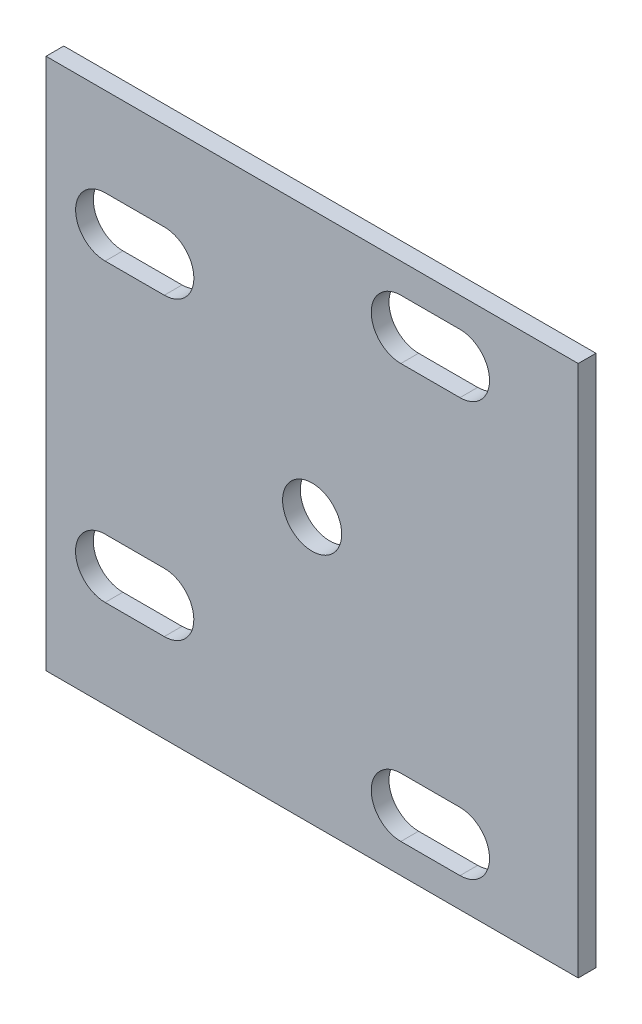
ISO-10303-21;
HEADER;
FILE_DESCRIPTION(('STEP AP214'),'2;1');
FILE_NAME('part.step','',(''),(''),'','','');
FILE_SCHEMA(('AUTOMOTIVE_DESIGN { 1 0 10303 214 1 1 1 1 }'));
ENDSEC;
DATA;
#1=APPLICATION_CONTEXT('core data for automotive mechanical design processes');
#2=APPLICATION_PROTOCOL_DEFINITION('international standard','automotive_design',2000,#1);
#3=PRODUCT_CONTEXT('',#1,'mechanical');
#4=PRODUCT('Part','Part','',(#3));
#5=PRODUCT_RELATED_PRODUCT_CATEGORY('part','',(#4));
#6=PRODUCT_DEFINITION_FORMATION('','',#4);
#7=PRODUCT_DEFINITION_CONTEXT('part definition',#1,'design');
#8=PRODUCT_DEFINITION('design','',#6,#7);
#9=PRODUCT_DEFINITION_SHAPE('','',#8);
#10=(LENGTH_UNIT() NAMED_UNIT(*) SI_UNIT(.MILLI.,.METRE.));
#11=(NAMED_UNIT(*) PLANE_ANGLE_UNIT() SI_UNIT($,.RADIAN.));
#12=(NAMED_UNIT(*) SI_UNIT($,.STERADIAN.) SOLID_ANGLE_UNIT());
#13=UNCERTAINTY_MEASURE_WITH_UNIT(LENGTH_MEASURE(1.E-05),#10,'distance_accuracy_value','');
#14=(GEOMETRIC_REPRESENTATION_CONTEXT(3) GLOBAL_UNCERTAINTY_ASSIGNED_CONTEXT((#13)) GLOBAL_UNIT_ASSIGNED_CONTEXT((#10,
#11,#12)) REPRESENTATION_CONTEXT('',''));
#15=CARTESIAN_POINT('',(0.,0.,0.));
#16=DIRECTION('',(0.,0.,1.));
#17=DIRECTION('',(1.,0.,0.));
#18=AXIS2_PLACEMENT_3D('',#15,#16,#17);
#19=CARTESIAN_POINT('',(0.,0.,3.));
#20=DIRECTION('',(0.,0.,-1.));
#21=DIRECTION('',(-1.,0.,0.));
#22=AXIS2_PLACEMENT_3D('',#19,#20,#21);
#23=PLANE('',#22);
#24=CARTESIAN_POINT('',(60.,80.,3.));
#25=DIRECTION('',(0.,0.,1.));
#26=DIRECTION('',(1.,0.,0.));
#27=AXIS2_PLACEMENT_3D('',#24,#25,#26);
#28=CIRCLE('',#27,5.);
#29=CARTESIAN_POINT('',(60.,85.,3.));
#30=VERTEX_POINT('',#29);
#31=CARTESIAN_POINT('',(60.,75.,3.));
#32=VERTEX_POINT('',#31);
#33=EDGE_CURVE('E209',#30,#32,#28,.T.);
#34=ORIENTED_EDGE('',*,*,#33,.F.);
#35=DIRECTION('',(-1.,0.,0.));
#36=VECTOR('',#35,1.);
#37=CARTESIAN_POINT('',(70.,85.,3.));
#38=LINE('',#37,#36);
#39=CARTESIAN_POINT('',(70.,85.,3.));
#40=VERTEX_POINT('',#39);
#41=EDGE_CURVE('E217',#40,#30,#38,.T.);
#42=ORIENTED_EDGE('',*,*,#41,.F.);
#43=CARTESIAN_POINT('',(70.,80.,3.));
#44=DIRECTION('',(0.,0.,1.));
#45=DIRECTION('',(1.,0.,0.));
#46=AXIS2_PLACEMENT_3D('',#43,#44,#45);
#47=CIRCLE('',#46,5.);
#48=CARTESIAN_POINT('',(70.,75.,3.));
#49=VERTEX_POINT('',#48);
#50=EDGE_CURVE('E214',#49,#40,#47,.T.);
#51=ORIENTED_EDGE('',*,*,#50,.F.);
#52=DIRECTION('',(1.,0.,0.));
#53=VECTOR('',#52,1.);
#54=CARTESIAN_POINT('',(70.,75.,3.));
#55=LINE('',#54,#53);
#56=EDGE_CURVE('E211',#32,#49,#55,.T.);
#57=ORIENTED_EDGE('',*,*,#56,.F.);
#58=EDGE_LOOP('',(#34,#42,#51,#57));
#59=FACE_BOUND('',#58,.T.);
#60=CARTESIAN_POINT('',(10.,70.,3.));
#61=DIRECTION('',(0.,0.,1.));
#62=DIRECTION('',(-1.,0.,0.));
#63=AXIS2_PLACEMENT_3D('',#60,#61,#62);
#64=CIRCLE('',#63,5.);
#65=CARTESIAN_POINT('',(10.,75.,3.));
#66=VERTEX_POINT('',#65);
#67=CARTESIAN_POINT('',(10.,65.,3.));
#68=VERTEX_POINT('',#67);
#69=EDGE_CURVE('E271',#66,#68,#64,.T.);
#70=ORIENTED_EDGE('',*,*,#69,.F.);
#71=DIRECTION('',(-1.,0.,0.));
#72=VECTOR('',#71,1.);
#73=CARTESIAN_POINT('',(10.,75.,3.));
#74=LINE('',#73,#72);
#75=CARTESIAN_POINT('',(20.,75.,3.));
#76=VERTEX_POINT('',#75);
#77=EDGE_CURVE('E279',#76,#66,#74,.T.);
#78=ORIENTED_EDGE('',*,*,#77,.F.);
#79=CARTESIAN_POINT('',(20.,70.,3.));
#80=DIRECTION('',(0.,0.,1.));
#81=DIRECTION('',(1.,0.,0.));
#82=AXIS2_PLACEMENT_3D('',#79,#80,#81);
#83=CIRCLE('',#82,5.);
#84=CARTESIAN_POINT('',(20.,65.,3.));
#85=VERTEX_POINT('',#84);
#86=EDGE_CURVE('E276',#85,#76,#83,.T.);
#87=ORIENTED_EDGE('',*,*,#86,.F.);
#88=DIRECTION('',(1.,0.,0.));
#89=VECTOR('',#88,1.);
#90=CARTESIAN_POINT('',(20.,65.,3.));
#91=LINE('',#90,#89);
#92=EDGE_CURVE('E273',#68,#85,#91,.T.);
#93=ORIENTED_EDGE('',*,*,#92,.F.);
#94=EDGE_LOOP('',(#70,#78,#87,#93));
#95=FACE_BOUND('',#94,.T.);
#96=DIRECTION('',(0.,-1.,0.));
#97=VECTOR('',#96,1.);
#98=CARTESIAN_POINT('',(0.,0.,3.));
#99=LINE('',#98,#97);
#100=CARTESIAN_POINT('',(0.,90.,3.));
#101=VERTEX_POINT('',#100);
#102=CARTESIAN_POINT('',(0.,0.,3.));
#103=VERTEX_POINT('',#102);
#104=EDGE_CURVE('E302',#101,#103,#99,.T.);
#105=ORIENTED_EDGE('',*,*,#104,.T.);
#106=DIRECTION('',(1.,0.,0.));
#107=VECTOR('',#106,1.);
#108=CARTESIAN_POINT('',(0.,0.,3.));
#109=LINE('',#108,#107);
#110=CARTESIAN_POINT('',(90.,0.,3.));
#111=VERTEX_POINT('',#110);
#112=EDGE_CURVE('E305',#103,#111,#109,.T.);
#113=ORIENTED_EDGE('',*,*,#112,.T.);
#114=DIRECTION('',(0.,1.,0.));
#115=VECTOR('',#114,1.);
#116=CARTESIAN_POINT('',(90.,0.,3.));
#117=LINE('',#116,#115);
#118=CARTESIAN_POINT('',(90.,90.,3.));
#119=VERTEX_POINT('',#118);
#120=EDGE_CURVE('E308',#111,#119,#117,.T.);
#121=ORIENTED_EDGE('',*,*,#120,.T.);
#122=DIRECTION('',(-1.,0.,0.));
#123=VECTOR('',#122,1.);
#124=CARTESIAN_POINT('',(0.,90.,3.));
#125=LINE('',#124,#123);
#126=EDGE_CURVE('E310',#119,#101,#125,.T.);
#127=ORIENTED_EDGE('',*,*,#126,.T.);
#128=EDGE_LOOP('',(#105,#113,#121,#127));
#129=FACE_BOUND('',#128,.T.);
#130=CARTESIAN_POINT('',(9.99115134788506,20.,3.));
#131=DIRECTION('',(0.,0.,1.));
#132=DIRECTION('',(-1.,0.,0.));
#133=AXIS2_PLACEMENT_3D('',#130,#131,#132);
#134=CIRCLE('',#133,5.);
#135=CARTESIAN_POINT('',(9.99115134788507,25.,3.));
#136=VERTEX_POINT('',#135);
#137=CARTESIAN_POINT('',(9.99115134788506,15.,3.));
#138=VERTEX_POINT('',#137);
#139=EDGE_CURVE('E240',#136,#138,#134,.T.);
#140=ORIENTED_EDGE('',*,*,#139,.F.);
#141=DIRECTION('',(-1.,0.,0.));
#142=VECTOR('',#141,1.);
#143=CARTESIAN_POINT('',(9.99115134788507,25.,3.));
#144=LINE('',#143,#142);
#145=CARTESIAN_POINT('',(19.9911513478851,25.,3.));
#146=VERTEX_POINT('',#145);
#147=EDGE_CURVE('E248',#146,#136,#144,.T.);
#148=ORIENTED_EDGE('',*,*,#147,.F.);
#149=CARTESIAN_POINT('',(19.9911513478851,20.,3.));
#150=DIRECTION('',(0.,0.,1.));
#151=DIRECTION('',(1.,0.,0.));
#152=AXIS2_PLACEMENT_3D('',#149,#150,#151);
#153=CIRCLE('',#152,5.);
#154=CARTESIAN_POINT('',(19.9911513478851,15.,3.));
#155=VERTEX_POINT('',#154);
#156=EDGE_CURVE('E245',#155,#146,#153,.T.);
#157=ORIENTED_EDGE('',*,*,#156,.F.);
#158=DIRECTION('',(1.,0.,0.));
#159=VECTOR('',#158,1.);
#160=CARTESIAN_POINT('',(19.9911513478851,15.,3.));
#161=LINE('',#160,#159);
#162=EDGE_CURVE('E242',#138,#155,#161,.T.);
#163=ORIENTED_EDGE('',*,*,#162,.F.);
#164=EDGE_LOOP('',(#140,#148,#157,#163));
#165=FACE_BOUND('',#164,.T.);
#166=CARTESIAN_POINT('',(60.,10.,3.));
#167=DIRECTION('',(0.,0.,1.));
#168=DIRECTION('',(-1.,0.,0.));
#169=AXIS2_PLACEMENT_3D('',#166,#167,#168);
#170=CIRCLE('',#169,5.);
#171=CARTESIAN_POINT('',(60.,15.,3.));
#172=VERTEX_POINT('',#171);
#173=CARTESIAN_POINT('',(60.,5.,3.));
#174=VERTEX_POINT('',#173);
#175=EDGE_CURVE('E170',#172,#174,#170,.T.);
#176=ORIENTED_EDGE('',*,*,#175,.F.);
#177=DIRECTION('',(-1.,0.,0.));
#178=VECTOR('',#177,1.);
#179=CARTESIAN_POINT('',(60.,15.,3.));
#180=LINE('',#179,#178);
#181=CARTESIAN_POINT('',(70.,15.,3.));
#182=VERTEX_POINT('',#181);
#183=EDGE_CURVE('E193',#182,#172,#180,.T.);
#184=ORIENTED_EDGE('',*,*,#183,.F.);
#185=CARTESIAN_POINT('',(70.,10.,3.));
#186=DIRECTION('',(0.,0.,1.));
#187=DIRECTION('',(1.,0.,0.));
#188=AXIS2_PLACEMENT_3D('',#185,#186,#187);
#189=CIRCLE('',#188,5.);
#190=CARTESIAN_POINT('',(70.,5.,3.));
#191=VERTEX_POINT('',#190);
#192=EDGE_CURVE('E191',#191,#182,#189,.T.);
#193=ORIENTED_EDGE('',*,*,#192,.F.);
#194=DIRECTION('',(1.,0.,0.));
#195=VECTOR('',#194,1.);
#196=CARTESIAN_POINT('',(70.,5.,3.));
#197=LINE('',#196,#195);
#198=EDGE_CURVE('E178',#174,#191,#197,.T.);
#199=ORIENTED_EDGE('',*,*,#198,.F.);
#200=EDGE_LOOP('',(#176,#184,#193,#199));
#201=FACE_BOUND('',#200,.T.);
#202=CARTESIAN_POINT('',(45.,45.,3.));
#203=DIRECTION('',(0.,0.,1.));
#204=DIRECTION('',(1.,0.,0.));
#205=AXIS2_PLACEMENT_3D('',#202,#203,#204);
#206=CIRCLE('',#205,5.);
#207=CARTESIAN_POINT('',(50.,45.,3.));
#208=VERTEX_POINT('',#207);
#209=EDGE_CURVE('E199',#208,#208,#206,.T.);
#210=ORIENTED_EDGE('',*,*,#209,.F.);
#211=EDGE_LOOP('',(#210));
#212=FACE_BOUND('',#211,.T.);
#213=ADVANCED_FACE('F33',(#59,#95,#129,#165,#201,#212),#23,.F.);
#214=CARTESIAN_POINT('',(0.,0.,0.));
#215=DIRECTION('',(0.,0.,-1.));
#216=DIRECTION('',(-1.,0.,0.));
#217=AXIS2_PLACEMENT_3D('',#214,#215,#216);
#218=PLANE('',#217);
#219=DIRECTION('',(-1.,0.,0.));
#220=VECTOR('',#219,1.);
#221=CARTESIAN_POINT('',(60.,15.,0.));
#222=LINE('',#221,#220);
#223=CARTESIAN_POINT('',(70.,15.,0.));
#224=VERTEX_POINT('',#223);
#225=CARTESIAN_POINT('',(60.,15.,0.));
#226=VERTEX_POINT('',#225);
#227=EDGE_CURVE('E179',#224,#226,#222,.T.);
#228=ORIENTED_EDGE('',*,*,#227,.T.);
#229=CARTESIAN_POINT('',(60.,10.,0.));
#230=DIRECTION('',(0.,0.,1.));
#231=DIRECTION('',(-1.,0.,0.));
#232=AXIS2_PLACEMENT_3D('',#229,#230,#231);
#233=CIRCLE('',#232,5.);
#234=CARTESIAN_POINT('',(60.,5.,0.));
#235=VERTEX_POINT('',#234);
#236=EDGE_CURVE('E56',#226,#235,#233,.T.);
#237=ORIENTED_EDGE('',*,*,#236,.T.);
#238=DIRECTION('',(1.,0.,0.));
#239=VECTOR('',#238,1.);
#240=CARTESIAN_POINT('',(70.,5.,0.));
#241=LINE('',#240,#239);
#242=CARTESIAN_POINT('',(70.,5.,0.));
#243=VERTEX_POINT('',#242);
#244=EDGE_CURVE('E185',#235,#243,#241,.T.);
#245=ORIENTED_EDGE('',*,*,#244,.T.);
#246=CARTESIAN_POINT('',(70.,10.,0.));
#247=DIRECTION('',(0.,0.,1.));
#248=DIRECTION('',(1.,0.,0.));
#249=AXIS2_PLACEMENT_3D('',#246,#247,#248);
#250=CIRCLE('',#249,5.);
#251=EDGE_CURVE('E201',#243,#224,#250,.T.);
#252=ORIENTED_EDGE('',*,*,#251,.T.);
#253=EDGE_LOOP('',(#228,#237,#245,#252));
#254=FACE_BOUND('',#253,.T.);
#255=DIRECTION('',(-1.,0.,0.));
#256=VECTOR('',#255,1.);
#257=CARTESIAN_POINT('',(70.,85.,0.));
#258=LINE('',#257,#256);
#259=CARTESIAN_POINT('',(70.,85.,0.));
#260=VERTEX_POINT('',#259);
#261=CARTESIAN_POINT('',(60.,85.,0.));
#262=VERTEX_POINT('',#261);
#263=EDGE_CURVE('E212',#260,#262,#258,.T.);
#264=ORIENTED_EDGE('',*,*,#263,.T.);
#265=CARTESIAN_POINT('',(60.,80.,0.));
#266=DIRECTION('',(0.,0.,1.));
#267=DIRECTION('',(1.,0.,0.));
#268=AXIS2_PLACEMENT_3D('',#265,#266,#267);
#269=CIRCLE('',#268,5.);
#270=CARTESIAN_POINT('',(60.,75.,0.));
#271=VERTEX_POINT('',#270);
#272=EDGE_CURVE('E186',#262,#271,#269,.T.);
#273=ORIENTED_EDGE('',*,*,#272,.T.);
#274=DIRECTION('',(1.,0.,0.));
#275=VECTOR('',#274,1.);
#276=CARTESIAN_POINT('',(70.,75.,0.));
#277=LINE('',#276,#275);
#278=CARTESIAN_POINT('',(70.,75.,0.));
#279=VERTEX_POINT('',#278);
#280=EDGE_CURVE('E222',#271,#279,#277,.T.);
#281=ORIENTED_EDGE('',*,*,#280,.T.);
#282=CARTESIAN_POINT('',(70.,80.,0.));
#283=DIRECTION('',(0.,0.,1.));
#284=DIRECTION('',(1.,0.,0.));
#285=AXIS2_PLACEMENT_3D('',#282,#283,#284);
#286=CIRCLE('',#285,5.);
#287=EDGE_CURVE('E225',#279,#260,#286,.T.);
#288=ORIENTED_EDGE('',*,*,#287,.T.);
#289=EDGE_LOOP('',(#264,#273,#281,#288));
#290=FACE_BOUND('',#289,.T.);
#291=DIRECTION('',(-1.,0.,0.));
#292=VECTOR('',#291,1.);
#293=CARTESIAN_POINT('',(9.99115134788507,25.,0.));
#294=LINE('',#293,#292);
#295=CARTESIAN_POINT('',(19.9911513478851,25.,0.));
#296=VERTEX_POINT('',#295);
#297=CARTESIAN_POINT('',(9.99115134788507,25.,0.));
#298=VERTEX_POINT('',#297);
#299=EDGE_CURVE('E243',#296,#298,#294,.T.);
#300=ORIENTED_EDGE('',*,*,#299,.T.);
#301=CARTESIAN_POINT('',(9.99115134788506,20.,0.));
#302=DIRECTION('',(0.,0.,1.));
#303=DIRECTION('',(-1.,0.,0.));
#304=AXIS2_PLACEMENT_3D('',#301,#302,#303);
#305=CIRCLE('',#304,5.);
#306=CARTESIAN_POINT('',(9.99115134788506,15.,0.));
#307=VERTEX_POINT('',#306);
#308=EDGE_CURVE('E239',#298,#307,#305,.T.);
#309=ORIENTED_EDGE('',*,*,#308,.T.);
#310=DIRECTION('',(1.,0.,0.));
#311=VECTOR('',#310,1.);
#312=CARTESIAN_POINT('',(19.9911513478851,15.,0.));
#313=LINE('',#312,#311);
#314=CARTESIAN_POINT('',(19.9911513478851,15.,0.));
#315=VERTEX_POINT('',#314);
#316=EDGE_CURVE('E253',#307,#315,#313,.T.);
#317=ORIENTED_EDGE('',*,*,#316,.T.);
#318=CARTESIAN_POINT('',(19.9911513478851,20.,0.));
#319=DIRECTION('',(0.,0.,1.));
#320=DIRECTION('',(1.,0.,0.));
#321=AXIS2_PLACEMENT_3D('',#318,#319,#320);
#322=CIRCLE('',#321,5.);
#323=EDGE_CURVE('E256',#315,#296,#322,.T.);
#324=ORIENTED_EDGE('',*,*,#323,.T.);
#325=EDGE_LOOP('',(#300,#309,#317,#324));
#326=FACE_BOUND('',#325,.T.);
#327=DIRECTION('',(-1.,0.,0.));
#328=VECTOR('',#327,1.);
#329=CARTESIAN_POINT('',(10.,75.,0.));
#330=LINE('',#329,#328);
#331=CARTESIAN_POINT('',(20.,75.,0.));
#332=VERTEX_POINT('',#331);
#333=CARTESIAN_POINT('',(10.,75.,0.));
#334=VERTEX_POINT('',#333);
#335=EDGE_CURVE('E274',#332,#334,#330,.T.);
#336=ORIENTED_EDGE('',*,*,#335,.T.);
#337=CARTESIAN_POINT('',(10.,70.,0.));
#338=DIRECTION('',(0.,0.,1.));
#339=DIRECTION('',(-1.,0.,0.));
#340=AXIS2_PLACEMENT_3D('',#337,#338,#339);
#341=CIRCLE('',#340,5.);
#342=CARTESIAN_POINT('',(10.,65.,0.));
#343=VERTEX_POINT('',#342);
#344=EDGE_CURVE('E270',#334,#343,#341,.T.);
#345=ORIENTED_EDGE('',*,*,#344,.T.);
#346=DIRECTION('',(1.,0.,0.));
#347=VECTOR('',#346,1.);
#348=CARTESIAN_POINT('',(20.,65.,0.));
#349=LINE('',#348,#347);
#350=CARTESIAN_POINT('',(20.,65.,0.));
#351=VERTEX_POINT('',#350);
#352=EDGE_CURVE('E284',#343,#351,#349,.T.);
#353=ORIENTED_EDGE('',*,*,#352,.T.);
#354=CARTESIAN_POINT('',(20.,70.,0.));
#355=DIRECTION('',(0.,0.,1.));
#356=DIRECTION('',(1.,0.,0.));
#357=AXIS2_PLACEMENT_3D('',#354,#355,#356);
#358=CIRCLE('',#357,5.);
#359=EDGE_CURVE('E287',#351,#332,#358,.T.);
#360=ORIENTED_EDGE('',*,*,#359,.T.);
#361=EDGE_LOOP('',(#336,#345,#353,#360));
#362=FACE_BOUND('',#361,.T.);
#363=DIRECTION('',(0.,-1.,0.));
#364=VECTOR('',#363,1.);
#365=CARTESIAN_POINT('',(0.,0.,0.));
#366=LINE('',#365,#364);
#367=CARTESIAN_POINT('',(0.,90.,0.));
#368=VERTEX_POINT('',#367);
#369=CARTESIAN_POINT('',(0.,0.,0.));
#370=VERTEX_POINT('',#369);
#371=EDGE_CURVE('E301',#368,#370,#366,.T.);
#372=ORIENTED_EDGE('',*,*,#371,.F.);
#373=DIRECTION('',(-1.,0.,0.));
#374=VECTOR('',#373,1.);
#375=CARTESIAN_POINT('',(0.,90.,0.));
#376=LINE('',#375,#374);
#377=CARTESIAN_POINT('',(90.,90.,0.));
#378=VERTEX_POINT('',#377);
#379=EDGE_CURVE('E306',#378,#368,#376,.T.);
#380=ORIENTED_EDGE('',*,*,#379,.F.);
#381=DIRECTION('',(0.,1.,0.));
#382=VECTOR('',#381,1.);
#383=CARTESIAN_POINT('',(90.,0.,0.));
#384=LINE('',#383,#382);
#385=CARTESIAN_POINT('',(90.,0.,0.));
#386=VERTEX_POINT('',#385);
#387=EDGE_CURVE('E317',#386,#378,#384,.T.);
#388=ORIENTED_EDGE('',*,*,#387,.F.);
#389=DIRECTION('',(1.,0.,0.));
#390=VECTOR('',#389,1.);
#391=CARTESIAN_POINT('',(0.,0.,0.));
#392=LINE('',#391,#390);
#393=EDGE_CURVE('E315',#370,#386,#392,.T.);
#394=ORIENTED_EDGE('',*,*,#393,.F.);
#395=EDGE_LOOP('',(#372,#380,#388,#394));
#396=FACE_BOUND('',#395,.T.);
#397=CARTESIAN_POINT('',(45.,45.,0.));
#398=DIRECTION('',(0.,0.,1.));
#399=DIRECTION('',(1.,0.,0.));
#400=AXIS2_PLACEMENT_3D('',#397,#398,#399);
#401=CIRCLE('',#400,5.);
#402=CARTESIAN_POINT('',(50.,45.,0.));
#403=VERTEX_POINT('',#402);
#404=EDGE_CURVE('E451',#403,#403,#401,.T.);
#405=ORIENTED_EDGE('',*,*,#404,.T.);
#406=EDGE_LOOP('',(#405));
#407=FACE_BOUND('',#406,.T.);
#408=ADVANCED_FACE('F335',(#254,#290,#326,#362,#396,#407),#218,.T.);
#409=CARTESIAN_POINT('',(0.,0.,3.));
#410=DIRECTION('',(1.,0.,0.));
#411=DIRECTION('',(0.,0.,-1.));
#412=AXIS2_PLACEMENT_3D('',#409,#410,#411);
#413=PLANE('',#412);
#414=ORIENTED_EDGE('',*,*,#371,.T.);
#415=DIRECTION('',(0.,0.,-1.));
#416=VECTOR('',#415,1.);
#417=CARTESIAN_POINT('',(0.,0.,3.));
#418=LINE('',#417,#416);
#419=EDGE_CURVE('E11',#103,#370,#418,.T.);
#420=ORIENTED_EDGE('',*,*,#419,.F.);
#421=ORIENTED_EDGE('',*,*,#104,.F.);
#422=DIRECTION('',(0.,0.,-1.));
#423=VECTOR('',#422,1.);
#424=CARTESIAN_POINT('',(0.,90.,3.));
#425=LINE('',#424,#423);
#426=EDGE_CURVE('E312',#101,#368,#425,.T.);
#427=ORIENTED_EDGE('',*,*,#426,.T.);
#428=EDGE_LOOP('',(#414,#420,#421,#427));
#429=FACE_BOUND('',#428,.T.);
#430=ADVANCED_FACE('F35',(#429),#413,.F.);
#431=CARTESIAN_POINT('',(0.,0.,3.));
#432=DIRECTION('',(0.,1.,0.));
#433=DIRECTION('',(0.,0.,1.));
#434=AXIS2_PLACEMENT_3D('',#431,#432,#433);
#435=PLANE('',#434);
#436=ORIENTED_EDGE('',*,*,#393,.T.);
#437=DIRECTION('',(0.,0.,-1.));
#438=VECTOR('',#437,1.);
#439=CARTESIAN_POINT('',(90.,0.,3.));
#440=LINE('',#439,#438);
#441=EDGE_CURVE('E41',#111,#386,#440,.T.);
#442=ORIENTED_EDGE('',*,*,#441,.F.);
#443=ORIENTED_EDGE('',*,*,#112,.F.);
#444=ORIENTED_EDGE('',*,*,#419,.T.);
#445=EDGE_LOOP('',(#436,#442,#443,#444));
#446=FACE_BOUND('',#445,.T.);
#447=ADVANCED_FACE('F346',(#446),#435,.F.);
#448=CARTESIAN_POINT('',(90.,0.,3.));
#449=DIRECTION('',(-1.,0.,0.));
#450=DIRECTION('',(0.,0.,1.));
#451=AXIS2_PLACEMENT_3D('',#448,#449,#450);
#452=PLANE('',#451);
#453=ORIENTED_EDGE('',*,*,#387,.T.);
#454=DIRECTION('',(0.,0.,-1.));
#455=VECTOR('',#454,1.);
#456=CARTESIAN_POINT('',(90.,90.,3.));
#457=LINE('',#456,#455);
#458=EDGE_CURVE('E322',#119,#378,#457,.T.);
#459=ORIENTED_EDGE('',*,*,#458,.F.);
#460=ORIENTED_EDGE('',*,*,#120,.F.);
#461=ORIENTED_EDGE('',*,*,#441,.T.);
#462=EDGE_LOOP('',(#453,#459,#460,#461));
#463=FACE_BOUND('',#462,.T.);
#464=ADVANCED_FACE('F329',(#463),#452,.F.);
#465=CARTESIAN_POINT('',(0.,90.,3.));
#466=DIRECTION('',(0.,-1.,0.));
#467=DIRECTION('',(0.,0.,-1.));
#468=AXIS2_PLACEMENT_3D('',#465,#466,#467);
#469=PLANE('',#468);
#470=ORIENTED_EDGE('',*,*,#379,.T.);
#471=ORIENTED_EDGE('',*,*,#426,.F.);
#472=ORIENTED_EDGE('',*,*,#126,.F.);
#473=ORIENTED_EDGE('',*,*,#458,.T.);
#474=EDGE_LOOP('',(#470,#471,#472,#473));
#475=FACE_BOUND('',#474,.T.);
#476=ADVANCED_FACE('F339',(#475),#469,.F.);
#477=CARTESIAN_POINT('',(10.,70.,3.));
#478=DIRECTION('',(0.,0.,-1.));
#479=DIRECTION('',(-1.,0.,0.));
#480=AXIS2_PLACEMENT_3D('',#477,#478,#479);
#481=CYLINDRICAL_SURFACE('',#480,5.);
#482=ORIENTED_EDGE('',*,*,#344,.F.);
#483=DIRECTION('',(0.,0.,-1.));
#484=VECTOR('',#483,1.);
#485=CARTESIAN_POINT('',(10.,75.,3.));
#486=LINE('',#485,#484);
#487=EDGE_CURVE('E281',#66,#334,#486,.T.);
#488=ORIENTED_EDGE('',*,*,#487,.F.);
#489=ORIENTED_EDGE('',*,*,#69,.T.);
#490=DIRECTION('',(0.,0.,-1.));
#491=VECTOR('',#490,1.);
#492=CARTESIAN_POINT('',(10.,65.,3.));
#493=LINE('',#492,#491);
#494=EDGE_CURVE('E298',#68,#343,#493,.T.);
#495=ORIENTED_EDGE('',*,*,#494,.T.);
#496=EDGE_LOOP('',(#482,#488,#489,#495));
#497=FACE_BOUND('',#496,.T.);
#498=ADVANCED_FACE('F364',(#497),#481,.F.);
#499=CARTESIAN_POINT('',(20.,65.,3.));
#500=DIRECTION('',(0.,1.,0.));
#501=DIRECTION('',(0.,0.,1.));
#502=AXIS2_PLACEMENT_3D('',#499,#500,#501);
#503=PLANE('',#502);
#504=ORIENTED_EDGE('',*,*,#352,.F.);
#505=ORIENTED_EDGE('',*,*,#494,.F.);
#506=ORIENTED_EDGE('',*,*,#92,.T.);
#507=DIRECTION('',(0.,0.,-1.));
#508=VECTOR('',#507,1.);
#509=CARTESIAN_POINT('',(20.,65.,3.));
#510=LINE('',#509,#508);
#511=EDGE_CURVE('E296',#85,#351,#510,.T.);
#512=ORIENTED_EDGE('',*,*,#511,.T.);
#513=EDGE_LOOP('',(#504,#505,#506,#512));
#514=FACE_BOUND('',#513,.T.);
#515=ADVANCED_FACE('F371',(#514),#503,.T.);
#516=CARTESIAN_POINT('',(20.,70.,3.));
#517=DIRECTION('',(0.,0.,-1.));
#518=DIRECTION('',(-1.,0.,0.));
#519=AXIS2_PLACEMENT_3D('',#516,#517,#518);
#520=CYLINDRICAL_SURFACE('',#519,5.);
#521=ORIENTED_EDGE('',*,*,#359,.F.);
#522=ORIENTED_EDGE('',*,*,#511,.F.);
#523=ORIENTED_EDGE('',*,*,#86,.T.);
#524=DIRECTION('',(0.,0.,-1.));
#525=VECTOR('',#524,1.);
#526=CARTESIAN_POINT('',(20.,75.,3.));
#527=LINE('',#526,#525);
#528=EDGE_CURVE('E294',#76,#332,#527,.T.);
#529=ORIENTED_EDGE('',*,*,#528,.T.);
#530=EDGE_LOOP('',(#521,#522,#523,#529));
#531=FACE_BOUND('',#530,.T.);
#532=ADVANCED_FACE('F376',(#531),#520,.F.);
#533=CARTESIAN_POINT('',(10.,75.,3.));
#534=DIRECTION('',(0.,-1.,0.));
#535=DIRECTION('',(0.,0.,-1.));
#536=AXIS2_PLACEMENT_3D('',#533,#534,#535);
#537=PLANE('',#536);
#538=ORIENTED_EDGE('',*,*,#335,.F.);
#539=ORIENTED_EDGE('',*,*,#528,.F.);
#540=ORIENTED_EDGE('',*,*,#77,.T.);
#541=ORIENTED_EDGE('',*,*,#487,.T.);
#542=EDGE_LOOP('',(#538,#539,#540,#541));
#543=FACE_BOUND('',#542,.T.);
#544=ADVANCED_FACE('F384',(#543),#537,.T.);
#545=CARTESIAN_POINT('',(9.99115134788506,20.,3.));
#546=DIRECTION('',(0.,0.,-1.));
#547=DIRECTION('',(-1.,0.,0.));
#548=AXIS2_PLACEMENT_3D('',#545,#546,#547);
#549=CYLINDRICAL_SURFACE('',#548,5.);
#550=ORIENTED_EDGE('',*,*,#308,.F.);
#551=DIRECTION('',(0.,0.,-1.));
#552=VECTOR('',#551,1.);
#553=CARTESIAN_POINT('',(9.99115134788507,25.,3.));
#554=LINE('',#553,#552);
#555=EDGE_CURVE('E250',#136,#298,#554,.T.);
#556=ORIENTED_EDGE('',*,*,#555,.F.);
#557=ORIENTED_EDGE('',*,*,#139,.T.);
#558=DIRECTION('',(0.,0.,-1.));
#559=VECTOR('',#558,1.);
#560=CARTESIAN_POINT('',(9.99115134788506,15.,3.));
#561=LINE('',#560,#559);
#562=EDGE_CURVE('E267',#138,#307,#561,.T.);
#563=ORIENTED_EDGE('',*,*,#562,.T.);
#564=EDGE_LOOP('',(#550,#556,#557,#563));
#565=FACE_BOUND('',#564,.T.);
#566=ADVANCED_FACE('F396',(#565),#549,.F.);
#567=CARTESIAN_POINT('',(19.9911513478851,15.,3.));
#568=DIRECTION('',(0.,1.,0.));
#569=DIRECTION('',(0.,0.,1.));
#570=AXIS2_PLACEMENT_3D('',#567,#568,#569);
#571=PLANE('',#570);
#572=ORIENTED_EDGE('',*,*,#316,.F.);
#573=ORIENTED_EDGE('',*,*,#562,.F.);
#574=ORIENTED_EDGE('',*,*,#162,.T.);
#575=DIRECTION('',(0.,0.,-1.));
#576=VECTOR('',#575,1.);
#577=CARTESIAN_POINT('',(19.9911513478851,15.,3.));
#578=LINE('',#577,#576);
#579=EDGE_CURVE('E265',#155,#315,#578,.T.);
#580=ORIENTED_EDGE('',*,*,#579,.T.);
#581=EDGE_LOOP('',(#572,#573,#574,#580));
#582=FACE_BOUND('',#581,.T.);
#583=ADVANCED_FACE('F401',(#582),#571,.T.);
#584=CARTESIAN_POINT('',(19.9911513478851,20.,3.));
#585=DIRECTION('',(0.,0.,-1.));
#586=DIRECTION('',(-1.,0.,0.));
#587=AXIS2_PLACEMENT_3D('',#584,#585,#586);
#588=CYLINDRICAL_SURFACE('',#587,5.);
#589=ORIENTED_EDGE('',*,*,#323,.F.);
#590=ORIENTED_EDGE('',*,*,#579,.F.);
#591=ORIENTED_EDGE('',*,*,#156,.T.);
#592=DIRECTION('',(0.,0.,-1.));
#593=VECTOR('',#592,1.);
#594=CARTESIAN_POINT('',(19.9911513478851,25.,3.));
#595=LINE('',#594,#593);
#596=EDGE_CURVE('E263',#146,#296,#595,.T.);
#597=ORIENTED_EDGE('',*,*,#596,.T.);
#598=EDGE_LOOP('',(#589,#590,#591,#597));
#599=FACE_BOUND('',#598,.T.);
#600=ADVANCED_FACE('F405',(#599),#588,.F.);
#601=CARTESIAN_POINT('',(9.99115134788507,25.,3.));
#602=DIRECTION('',(0.,-1.,0.));
#603=DIRECTION('',(0.,0.,-1.));
#604=AXIS2_PLACEMENT_3D('',#601,#602,#603);
#605=PLANE('',#604);
#606=ORIENTED_EDGE('',*,*,#299,.F.);
#607=ORIENTED_EDGE('',*,*,#596,.F.);
#608=ORIENTED_EDGE('',*,*,#147,.T.);
#609=ORIENTED_EDGE('',*,*,#555,.T.);
#610=EDGE_LOOP('',(#606,#607,#608,#609));
#611=FACE_BOUND('',#610,.T.);
#612=ADVANCED_FACE('F409',(#611),#605,.T.);
#613=CARTESIAN_POINT('',(60.,80.,3.));
#614=DIRECTION('',(0.,0.,-1.));
#615=DIRECTION('',(-1.,0.,0.));
#616=AXIS2_PLACEMENT_3D('',#613,#614,#615);
#617=CYLINDRICAL_SURFACE('',#616,5.);
#618=ORIENTED_EDGE('',*,*,#272,.F.);
#619=DIRECTION('',(0.,0.,-1.));
#620=VECTOR('',#619,1.);
#621=CARTESIAN_POINT('',(60.,85.,3.));
#622=LINE('',#621,#620);
#623=EDGE_CURVE('E219',#30,#262,#622,.T.);
#624=ORIENTED_EDGE('',*,*,#623,.F.);
#625=ORIENTED_EDGE('',*,*,#33,.T.);
#626=DIRECTION('',(0.,0.,-1.));
#627=VECTOR('',#626,1.);
#628=CARTESIAN_POINT('',(60.,75.,3.));
#629=LINE('',#628,#627);
#630=EDGE_CURVE('E236',#32,#271,#629,.T.);
#631=ORIENTED_EDGE('',*,*,#630,.T.);
#632=EDGE_LOOP('',(#618,#624,#625,#631));
#633=FACE_BOUND('',#632,.T.);
#634=ADVANCED_FACE('F413',(#633),#617,.F.);
#635=CARTESIAN_POINT('',(70.,75.,3.));
#636=DIRECTION('',(0.,1.,0.));
#637=DIRECTION('',(-1.,0.,0.));
#638=AXIS2_PLACEMENT_3D('',#635,#636,#637);
#639=PLANE('',#638);
#640=ORIENTED_EDGE('',*,*,#280,.F.);
#641=ORIENTED_EDGE('',*,*,#630,.F.);
#642=ORIENTED_EDGE('',*,*,#56,.T.);
#643=DIRECTION('',(0.,0.,-1.));
#644=VECTOR('',#643,1.);
#645=CARTESIAN_POINT('',(70.,75.,3.));
#646=LINE('',#645,#644);
#647=EDGE_CURVE('E234',#49,#279,#646,.T.);
#648=ORIENTED_EDGE('',*,*,#647,.T.);
#649=EDGE_LOOP('',(#640,#641,#642,#648));
#650=FACE_BOUND('',#649,.T.);
#651=ADVANCED_FACE('F417',(#650),#639,.T.);
#652=CARTESIAN_POINT('',(70.,80.,3.));
#653=DIRECTION('',(0.,0.,-1.));
#654=DIRECTION('',(-1.,0.,0.));
#655=AXIS2_PLACEMENT_3D('',#652,#653,#654);
#656=CYLINDRICAL_SURFACE('',#655,5.);
#657=ORIENTED_EDGE('',*,*,#287,.F.);
#658=ORIENTED_EDGE('',*,*,#647,.F.);
#659=ORIENTED_EDGE('',*,*,#50,.T.);
#660=DIRECTION('',(0.,0.,-1.));
#661=VECTOR('',#660,1.);
#662=CARTESIAN_POINT('',(70.,85.,3.));
#663=LINE('',#662,#661);
#664=EDGE_CURVE('E232',#40,#260,#663,.T.);
#665=ORIENTED_EDGE('',*,*,#664,.T.);
#666=EDGE_LOOP('',(#657,#658,#659,#665));
#667=FACE_BOUND('',#666,.T.);
#668=ADVANCED_FACE('F421',(#667),#656,.F.);
#669=CARTESIAN_POINT('',(70.,85.,3.));
#670=DIRECTION('',(0.,-1.,0.));
#671=DIRECTION('',(1.,0.,0.));
#672=AXIS2_PLACEMENT_3D('',#669,#670,#671);
#673=PLANE('',#672);
#674=ORIENTED_EDGE('',*,*,#263,.F.);
#675=ORIENTED_EDGE('',*,*,#664,.F.);
#676=ORIENTED_EDGE('',*,*,#41,.T.);
#677=ORIENTED_EDGE('',*,*,#623,.T.);
#678=EDGE_LOOP('',(#674,#675,#676,#677));
#679=FACE_BOUND('',#678,.T.);
#680=ADVANCED_FACE('F425',(#679),#673,.T.);
#681=CARTESIAN_POINT('',(60.,10.,3.));
#682=DIRECTION('',(0.,0.,-1.));
#683=DIRECTION('',(-1.,0.,0.));
#684=AXIS2_PLACEMENT_3D('',#681,#682,#683);
#685=CYLINDRICAL_SURFACE('',#684,5.);
#686=ORIENTED_EDGE('',*,*,#236,.F.);
#687=DIRECTION('',(0.,0.,-1.));
#688=VECTOR('',#687,1.);
#689=CARTESIAN_POINT('',(60.,15.,3.));
#690=LINE('',#689,#688);
#691=EDGE_CURVE('E174',#172,#226,#690,.T.);
#692=ORIENTED_EDGE('',*,*,#691,.F.);
#693=ORIENTED_EDGE('',*,*,#175,.T.);
#694=DIRECTION('',(0.,0.,-1.));
#695=VECTOR('',#694,1.);
#696=CARTESIAN_POINT('',(60.,5.,3.));
#697=LINE('',#696,#695);
#698=EDGE_CURVE('E173',#174,#235,#697,.T.);
#699=ORIENTED_EDGE('',*,*,#698,.T.);
#700=EDGE_LOOP('',(#686,#692,#693,#699));
#701=FACE_BOUND('',#700,.T.);
#702=ADVANCED_FACE('F172',(#701),#685,.F.);
#703=CARTESIAN_POINT('',(70.,5.,3.));
#704=DIRECTION('',(0.,1.,0.));
#705=DIRECTION('',(0.,0.,1.));
#706=AXIS2_PLACEMENT_3D('',#703,#704,#705);
#707=PLANE('',#706);
#708=ORIENTED_EDGE('',*,*,#244,.F.);
#709=ORIENTED_EDGE('',*,*,#698,.F.);
#710=ORIENTED_EDGE('',*,*,#198,.T.);
#711=DIRECTION('',(0.,0.,-1.));
#712=VECTOR('',#711,1.);
#713=CARTESIAN_POINT('',(70.,5.,3.));
#714=LINE('',#713,#712);
#715=EDGE_CURVE('E187',#191,#243,#714,.T.);
#716=ORIENTED_EDGE('',*,*,#715,.T.);
#717=EDGE_LOOP('',(#708,#709,#710,#716));
#718=FACE_BOUND('',#717,.T.);
#719=ADVANCED_FACE('F182',(#718),#707,.T.);
#720=CARTESIAN_POINT('',(70.,10.,3.));
#721=DIRECTION('',(0.,0.,-1.));
#722=DIRECTION('',(-1.,0.,0.));
#723=AXIS2_PLACEMENT_3D('',#720,#721,#722);
#724=CYLINDRICAL_SURFACE('',#723,5.);
#725=ORIENTED_EDGE('',*,*,#251,.F.);
#726=ORIENTED_EDGE('',*,*,#715,.F.);
#727=ORIENTED_EDGE('',*,*,#192,.T.);
#728=DIRECTION('',(0.,0.,-1.));
#729=VECTOR('',#728,1.);
#730=CARTESIAN_POINT('',(70.,15.,3.));
#731=LINE('',#730,#729);
#732=EDGE_CURVE('E48',#182,#224,#731,.T.);
#733=ORIENTED_EDGE('',*,*,#732,.T.);
#734=EDGE_LOOP('',(#725,#726,#727,#733));
#735=FACE_BOUND('',#734,.T.);
#736=ADVANCED_FACE('F434',(#735),#724,.F.);
#737=CARTESIAN_POINT('',(60.,15.,3.));
#738=DIRECTION('',(0.,-1.,0.));
#739=DIRECTION('',(1.,0.,0.));
#740=AXIS2_PLACEMENT_3D('',#737,#738,#739);
#741=PLANE('',#740);
#742=ORIENTED_EDGE('',*,*,#227,.F.);
#743=ORIENTED_EDGE('',*,*,#732,.F.);
#744=ORIENTED_EDGE('',*,*,#183,.T.);
#745=ORIENTED_EDGE('',*,*,#691,.T.);
#746=EDGE_LOOP('',(#742,#743,#744,#745));
#747=FACE_BOUND('',#746,.T.);
#748=ADVANCED_FACE('F437',(#747),#741,.T.);
#749=CARTESIAN_POINT('',(45.,45.,3.));
#750=DIRECTION('',(0.,0.,-1.));
#751=DIRECTION('',(-1.,0.,0.));
#752=AXIS2_PLACEMENT_3D('',#749,#750,#751);
#753=CYLINDRICAL_SURFACE('',#752,5.);
#754=ORIENTED_EDGE('',*,*,#209,.T.);
#755=EDGE_LOOP('',(#754));
#756=FACE_BOUND('',#755,.T.);
#757=ORIENTED_EDGE('',*,*,#404,.F.);
#758=EDGE_LOOP('',(#757));
#759=FACE_BOUND('',#758,.T.);
#760=ADVANCED_FACE('F441',(#756,#759),#753,.F.);
#761=CLOSED_SHELL('',(#213,#408,#430,#447,#464,#476,#498,#515,#532,#544,#566,#583,#600,#612,
#634,#651,#668,#680,#702,#719,#736,#748,#760));
#762=MANIFOLD_SOLID_BREP('B2',#761);
#763=ADVANCED_BREP_SHAPE_REPRESENTATION('',(#18,#762),#14);
#764=SHAPE_DEFINITION_REPRESENTATION(#9,#763);
ENDSEC;
END-ISO-10303-21;
